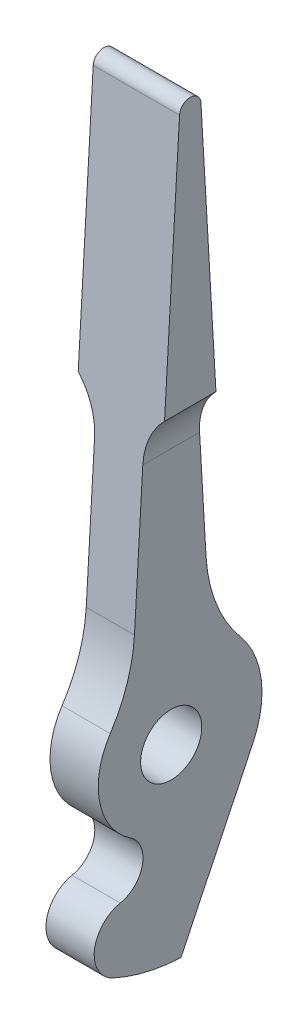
ISO-10303-21;
HEADER;
FILE_DESCRIPTION(('STEP AP214'),'2;1');
FILE_NAME('part.step','',(''),(''),'','','');
FILE_SCHEMA(('AUTOMOTIVE_DESIGN { 1 0 10303 214 1 1 1 1 }'));
ENDSEC;
DATA;
#1=APPLICATION_CONTEXT('core data for automotive mechanical design processes');
#2=APPLICATION_PROTOCOL_DEFINITION('international standard','automotive_design',2000,#1);
#3=PRODUCT_CONTEXT('',#1,'mechanical');
#4=PRODUCT('Part','Part','',(#3));
#5=PRODUCT_RELATED_PRODUCT_CATEGORY('part','',(#4));
#6=PRODUCT_DEFINITION_FORMATION('','',#4);
#7=PRODUCT_DEFINITION_CONTEXT('part definition',#1,'design');
#8=PRODUCT_DEFINITION('design','',#6,#7);
#9=PRODUCT_DEFINITION_SHAPE('','',#8);
#10=(LENGTH_UNIT() NAMED_UNIT(*) SI_UNIT(.MILLI.,.METRE.));
#11=(NAMED_UNIT(*) PLANE_ANGLE_UNIT() SI_UNIT($,.RADIAN.));
#12=(NAMED_UNIT(*) SI_UNIT($,.STERADIAN.) SOLID_ANGLE_UNIT());
#13=UNCERTAINTY_MEASURE_WITH_UNIT(LENGTH_MEASURE(1.E-05),#10,'distance_accuracy_value','');
#14=(GEOMETRIC_REPRESENTATION_CONTEXT(3) GLOBAL_UNCERTAINTY_ASSIGNED_CONTEXT((#13)) GLOBAL_UNIT_ASSIGNED_CONTEXT((#10,
#11,#12)) REPRESENTATION_CONTEXT('',''));
#15=CARTESIAN_POINT('',(0.,0.,0.));
#16=DIRECTION('',(0.,0.,1.));
#17=DIRECTION('',(1.,0.,0.));
#18=AXIS2_PLACEMENT_3D('',#15,#16,#17);
#19=CARTESIAN_POINT('',(3.683,-0.694727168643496,-1.46970668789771));
#20=DIRECTION('',(-1.,0.,0.));
#21=DIRECTION('',(0.,0.,1.));
#22=AXIS2_PLACEMENT_3D('',#19,#20,#21);
#23=PLANE('',#22);
#24=DIRECTION('',(0.,-0.998308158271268,0.0581448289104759));
#25=VECTOR('',#24,1.);
#26=CARTESIAN_POINT('',(3.683,9.65715088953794,3.13324255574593));
#27=LINE('',#26,#25);
#28=CARTESIAN_POINT('',(3.683,47.7797676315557,0.912852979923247));
#29=VERTEX_POINT('',#28);
#30=CARTESIAN_POINT('',(3.683,25.796875,2.19321067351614));
#31=VERTEX_POINT('',#30);
#32=EDGE_CURVE('E175',#29,#31,#27,.T.);
#33=ORIENTED_EDGE('',*,*,#32,.T.);
#34=DIRECTION('',(0.,0.,1.));
#35=VECTOR('',#34,1.);
#36=CARTESIAN_POINT('',(3.683,25.796875,-12.573));
#37=LINE('',#36,#35);
#38=CARTESIAN_POINT('',(3.683,25.796875,-2.19321067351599));
#39=VERTEX_POINT('',#38);
#40=EDGE_CURVE('E162',#39,#31,#37,.T.);
#41=ORIENTED_EDGE('',*,*,#40,.F.);
#42=DIRECTION('',(0.,0.998308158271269,0.0581448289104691));
#43=VECTOR('',#42,1.);
#44=CARTESIAN_POINT('',(3.683,47.7797676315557,-0.912852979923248));
#45=LINE('',#44,#43);
#46=CARTESIAN_POINT('',(3.683,47.7797676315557,-0.912852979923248));
#47=VERTEX_POINT('',#46);
#48=EDGE_CURVE('E179',#39,#47,#45,.T.);
#49=ORIENTED_EDGE('',*,*,#48,.T.);
#50=CARTESIAN_POINT('',(3.683,47.7266,0.));
#51=DIRECTION('',(1.,0.,0.));
#52=DIRECTION('',(0.,0.,-1.));
#53=AXIS2_PLACEMENT_3D('',#50,#51,#52);
#54=CIRCLE('',#53,0.9144);
#55=EDGE_CURVE('E276',#47,#29,#54,.T.);
#56=ORIENTED_EDGE('',*,*,#55,.T.);
#57=EDGE_LOOP('',(#33,#41,#49,#56));
#58=FACE_BOUND('',#57,.T.);
#59=ADVANCED_FACE('F36',(#58),#23,.F.);
#60=CARTESIAN_POINT('',(-3.683,-0.694727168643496,-1.46970668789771));
#61=DIRECTION('',(-1.,0.,0.));
#62=DIRECTION('',(0.,0.,1.));
#63=AXIS2_PLACEMENT_3D('',#60,#61,#62);
#64=PLANE('',#63);
#65=DIRECTION('',(0.,0.,1.));
#66=VECTOR('',#65,1.);
#67=CARTESIAN_POINT('',(-3.683,25.796875,-12.573));
#68=LINE('',#67,#66);
#69=CARTESIAN_POINT('',(-3.683,25.796875,-2.19321067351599));
#70=VERTEX_POINT('',#69);
#71=CARTESIAN_POINT('',(-3.683,25.796875,2.19321067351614));
#72=VERTEX_POINT('',#71);
#73=EDGE_CURVE('E142',#70,#72,#68,.T.);
#74=ORIENTED_EDGE('',*,*,#73,.T.);
#75=DIRECTION('',(0.,-0.998308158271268,0.0581448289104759));
#76=VECTOR('',#75,1.);
#77=CARTESIAN_POINT('',(-3.683,9.65715088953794,3.13324255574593));
#78=LINE('',#77,#76);
#79=CARTESIAN_POINT('',(-3.683,47.7797676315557,0.912852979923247));
#80=VERTEX_POINT('',#79);
#81=EDGE_CURVE('E169',#80,#72,#78,.T.);
#82=ORIENTED_EDGE('',*,*,#81,.F.);
#83=CARTESIAN_POINT('',(-3.683,47.7266,0.));
#84=DIRECTION('',(1.,0.,0.));
#85=DIRECTION('',(0.,0.,-1.));
#86=AXIS2_PLACEMENT_3D('',#83,#84,#85);
#87=CIRCLE('',#86,0.9144);
#88=CARTESIAN_POINT('',(-3.683,47.7797676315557,-0.912852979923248));
#89=VERTEX_POINT('',#88);
#90=EDGE_CURVE('E166',#89,#80,#87,.T.);
#91=ORIENTED_EDGE('',*,*,#90,.F.);
#92=DIRECTION('',(0.,0.998308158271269,0.0581448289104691));
#93=VECTOR('',#92,1.);
#94=CARTESIAN_POINT('',(-3.683,47.7797676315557,-0.912852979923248));
#95=LINE('',#94,#93);
#96=EDGE_CURVE('E158',#70,#89,#95,.T.);
#97=ORIENTED_EDGE('',*,*,#96,.F.);
#98=EDGE_LOOP('',(#74,#82,#91,#97));
#99=FACE_BOUND('',#98,.T.);
#100=ADVANCED_FACE('F165',(#99),#64,.T.);
#101=CARTESIAN_POINT('',(3.683,-0.694727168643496,-1.46970668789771));
#102=DIRECTION('',(-1.,0.,0.));
#103=DIRECTION('',(0.,0.,1.));
#104=AXIS2_PLACEMENT_3D('',#101,#102,#103);
#105=CYLINDRICAL_SURFACE('',#104,15.4686);
#106=DIRECTION('',(-1.,0.,0.));
#107=VECTOR('',#106,1.);
#108=CARTESIAN_POINT('',(3.683,-14.7682384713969,4.95009592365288));
#109=LINE('',#108,#107);
#110=CARTESIAN_POINT('',(2.0574,-14.7682384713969,4.95009592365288));
#111=VERTEX_POINT('',#110);
#112=CARTESIAN_POINT('',(-2.0574,-14.7682384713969,4.95009592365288));
#113=VERTEX_POINT('',#112);
#114=EDGE_CURVE('E180',#111,#113,#109,.T.);
#115=ORIENTED_EDGE('',*,*,#114,.T.);
#116=CARTESIAN_POINT('',(-2.0574,-0.694727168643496,-1.46970668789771));
#117=DIRECTION('',(1.,0.,0.));
#118=DIRECTION('',(0.,0.,-1.));
#119=AXIS2_PLACEMENT_3D('',#116,#117,#118);
#120=CIRCLE('',#119,15.4686);
#121=CARTESIAN_POINT('',(-2.0574,-16.1502613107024,-0.834057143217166));
#122=VERTEX_POINT('',#121);
#123=EDGE_CURVE('E51',#113,#122,#120,.T.);
#124=ORIENTED_EDGE('',*,*,#123,.T.);
#125=DIRECTION('',(-1.,0.,0.));
#126=VECTOR('',#125,1.);
#127=CARTESIAN_POINT('',(3.683,-16.1502613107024,-0.83405714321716));
#128=LINE('',#127,#126);
#129=CARTESIAN_POINT('',(2.0574,-16.1502613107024,-0.834057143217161));
#130=VERTEX_POINT('',#129);
#131=EDGE_CURVE('E208',#130,#122,#128,.T.);
#132=ORIENTED_EDGE('',*,*,#131,.F.);
#133=CARTESIAN_POINT('',(2.0574,-0.694727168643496,-1.46970668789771));
#134=DIRECTION('',(-1.,0.,0.));
#135=DIRECTION('',(0.,0.,1.));
#136=AXIS2_PLACEMENT_3D('',#133,#134,#135);
#137=CIRCLE('',#136,15.4686);
#138=EDGE_CURVE('E262',#130,#111,#137,.T.);
#139=ORIENTED_EDGE('',*,*,#138,.T.);
#140=EDGE_LOOP('',(#115,#124,#132,#139));
#141=FACE_BOUND('',#140,.T.);
#142=ADVANCED_FACE('F38',(#141),#105,.T.);
#143=CARTESIAN_POINT('',(3.683,-3.35549518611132,-6.98259701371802));
#144=DIRECTION('',(0.,0.433134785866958,0.901329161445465));
#145=DIRECTION('',(0.,-0.901329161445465,0.433134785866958));
#146=AXIS2_PLACEMENT_3D('',#143,#144,#145);
#147=PLANE('',#146);
#148=ORIENTED_EDGE('',*,*,#131,.T.);
#149=DIRECTION('',(0.,0.901329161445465,-0.433134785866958));
#150=VECTOR('',#149,1.);
#151=CARTESIAN_POINT('',(-2.0574,-3.35549518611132,-6.98259701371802));
#152=LINE('',#151,#150);
#153=CARTESIAN_POINT('',(-2.0574,-3.35549518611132,-6.98259701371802));
#154=VERTEX_POINT('',#153);
#155=EDGE_CURVE('E238',#122,#154,#152,.T.);
#156=ORIENTED_EDGE('',*,*,#155,.T.);
#157=DIRECTION('',(-1.,0.,0.));
#158=VECTOR('',#157,1.);
#159=CARTESIAN_POINT('',(3.683,-3.35549518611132,-6.98259701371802));
#160=LINE('',#159,#158);
#161=CARTESIAN_POINT('',(2.0574,-3.35549518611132,-6.98259701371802));
#162=VERTEX_POINT('',#161);
#163=EDGE_CURVE('E205',#162,#154,#160,.T.);
#164=ORIENTED_EDGE('',*,*,#163,.F.);
#165=DIRECTION('',(0.,-0.901329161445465,0.433134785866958));
#166=VECTOR('',#165,1.);
#167=CARTESIAN_POINT('',(2.0574,-3.35549518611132,-6.98259701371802));
#168=LINE('',#167,#166);
#169=EDGE_CURVE('E265',#162,#130,#168,.T.);
#170=ORIENTED_EDGE('',*,*,#169,.T.);
#171=EDGE_LOOP('',(#148,#156,#164,#170));
#172=FACE_BOUND('',#171,.T.);
#173=ADVANCED_FACE('F300',(#172),#147,.F.);
#174=CARTESIAN_POINT('',(3.683,0.,0.));
#175=DIRECTION('',(-1.,0.,0.));
#176=DIRECTION('',(0.,0.,1.));
#177=AXIS2_PLACEMENT_3D('',#174,#175,#176);
#178=CYLINDRICAL_SURFACE('',#177,7.747);
#179=ORIENTED_EDGE('',*,*,#163,.T.);
#180=CARTESIAN_POINT('',(-2.0574,0.,0.));
#181=DIRECTION('',(1.,0.,0.));
#182=DIRECTION('',(0.,0.,-1.));
#183=AXIS2_PLACEMENT_3D('',#180,#181,#182);
#184=CIRCLE('',#183,7.747);
#185=CARTESIAN_POINT('',(-2.0574,4.98528738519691,-5.92983293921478));
#186=VERTEX_POINT('',#185);
#187=EDGE_CURVE('E241',#154,#186,#184,.T.);
#188=ORIENTED_EDGE('',*,*,#187,.T.);
#189=DIRECTION('',(-1.,0.,0.));
#190=VECTOR('',#189,1.);
#191=CARTESIAN_POINT('',(3.683,4.98528738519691,-5.92983293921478));
#192=LINE('',#191,#190);
#193=CARTESIAN_POINT('',(2.0574,4.98528738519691,-5.92983293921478));
#194=VERTEX_POINT('',#193);
#195=EDGE_CURVE('E202',#194,#186,#192,.T.);
#196=ORIENTED_EDGE('',*,*,#195,.F.);
#197=CARTESIAN_POINT('',(2.0574,0.,0.));
#198=DIRECTION('',(-1.,0.,0.));
#199=DIRECTION('',(0.,0.,1.));
#200=AXIS2_PLACEMENT_3D('',#197,#198,#199);
#201=CIRCLE('',#200,7.747);
#202=EDGE_CURVE('E268',#194,#162,#201,.T.);
#203=ORIENTED_EDGE('',*,*,#202,.T.);
#204=EDGE_LOOP('',(#179,#188,#196,#203));
#205=FACE_BOUND('',#204,.T.);
#206=ADVANCED_FACE('F297',(#205),#178,.T.);
#207=CARTESIAN_POINT('',(3.683,13.1578896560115,-15.6508705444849));
#208=DIRECTION('',(-1.,0.,0.));
#209=DIRECTION('',(0.,0.,1.));
#210=AXIS2_PLACEMENT_3D('',#207,#208,#209);
#211=CYLINDRICAL_SURFACE('',#210,12.7);
#212=ORIENTED_EDGE('',*,*,#195,.T.);
#213=CARTESIAN_POINT('',(-2.0574,13.1578896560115,-15.6508705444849));
#214=DIRECTION('',(1.,0.,0.));
#215=DIRECTION('',(0.,0.,-1.));
#216=AXIS2_PLACEMENT_3D('',#213,#214,#215);
#217=CIRCLE('',#216,12.7);
#218=CARTESIAN_POINT('',(-2.0574,12.4194503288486,-2.9723569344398));
#219=VERTEX_POINT('',#218);
#220=EDGE_CURVE('E244',#186,#219,#217,.F.);
#221=ORIENTED_EDGE('',*,*,#220,.T.);
#222=DIRECTION('',(-1.,0.,0.));
#223=VECTOR('',#222,1.);
#224=CARTESIAN_POINT('',(3.683,12.4194503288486,-2.9723569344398));
#225=LINE('',#224,#223);
#226=CARTESIAN_POINT('',(2.0574,12.4194503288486,-2.9723569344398));
#227=VERTEX_POINT('',#226);
#228=EDGE_CURVE('E200',#227,#219,#225,.T.);
#229=ORIENTED_EDGE('',*,*,#228,.F.);
#230=CARTESIAN_POINT('',(2.0574,13.1578896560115,-15.6508705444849));
#231=DIRECTION('',(-1.,0.,0.));
#232=DIRECTION('',(0.,0.,1.));
#233=AXIS2_PLACEMENT_3D('',#230,#231,#232);
#234=CIRCLE('',#233,12.7);
#235=EDGE_CURVE('E271',#227,#194,#234,.F.);
#236=ORIENTED_EDGE('',*,*,#235,.T.);
#237=EDGE_LOOP('',(#212,#221,#229,#236));
#238=FACE_BOUND('',#237,.T.);
#239=ADVANCED_FACE('F293',(#238),#211,.F.);
#240=CARTESIAN_POINT('',(3.683,47.7797676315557,-0.912852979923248));
#241=DIRECTION('',(0.,-0.0581448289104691,0.998308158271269));
#242=DIRECTION('',(0.,-0.998308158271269,-0.0581448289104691));
#243=AXIS2_PLACEMENT_3D('',#240,#241,#242);
#244=PLANE('',#243);
#245=DIRECTION('',(0.,0.998308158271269,0.0581448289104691));
#246=VECTOR('',#245,1.);
#247=CARTESIAN_POINT('',(-2.0574,47.7797676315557,-0.912852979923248));
#248=LINE('',#247,#246);
#249=CARTESIAN_POINT('',(-2.0574,21.8698017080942,-2.42193664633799));
#250=VERTEX_POINT('',#249);
#251=EDGE_CURVE('E161',#219,#250,#248,.T.);
#252=ORIENTED_EDGE('',*,*,#251,.T.);
#253=CARTESIAN_POINT('',(-7.61365,21.8698017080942,-2.42193664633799));
#254=DIRECTION('',(0.,-0.0581448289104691,0.998308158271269));
#255=DIRECTION('',(0.,0.998308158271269,0.0581448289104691));
#256=AXIS2_PLACEMENT_3D('',#253,#254,#255);
#257=ELLIPSE('',#256,5.56566622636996,5.55625);
#258=EDGE_CURVE('E146',#250,#70,#257,.T.);
#259=ORIENTED_EDGE('',*,*,#258,.T.);
#260=ORIENTED_EDGE('',*,*,#96,.T.);
#261=DIRECTION('',(-1.,0.,0.));
#262=VECTOR('',#261,1.);
#263=CARTESIAN_POINT('',(3.683,47.7797676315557,-0.912852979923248));
#264=LINE('',#263,#262);
#265=EDGE_CURVE('E198',#47,#89,#264,.T.);
#266=ORIENTED_EDGE('',*,*,#265,.F.);
#267=ORIENTED_EDGE('',*,*,#48,.F.);
#268=CARTESIAN_POINT('',(7.61365,21.8698017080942,-2.42193664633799));
#269=DIRECTION('',(0.,-0.0581448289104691,0.998308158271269));
#270=DIRECTION('',(0.,0.998308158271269,0.0581448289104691));
#271=AXIS2_PLACEMENT_3D('',#268,#269,#270);
#272=ELLIPSE('',#271,5.56566622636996,5.55625);
#273=CARTESIAN_POINT('',(2.0574,21.8698017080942,-2.42193664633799));
#274=VERTEX_POINT('',#273);
#275=EDGE_CURVE('E167',#39,#274,#272,.T.);
#276=ORIENTED_EDGE('',*,*,#275,.T.);
#277=DIRECTION('',(0.,-0.998308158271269,-0.0581448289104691));
#278=VECTOR('',#277,1.);
#279=CARTESIAN_POINT('',(2.0574,47.7797676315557,-0.912852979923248));
#280=LINE('',#279,#278);
#281=EDGE_CURVE('E172',#274,#227,#280,.T.);
#282=ORIENTED_EDGE('',*,*,#281,.T.);
#283=ORIENTED_EDGE('',*,*,#228,.T.);
#284=EDGE_LOOP('',(#252,#259,#260,#266,#267,#276,#282,#283));
#285=FACE_BOUND('',#284,.T.);
#286=ADVANCED_FACE('F156',(#285),#244,.F.);
#287=CARTESIAN_POINT('',(3.683,47.7266,0.));
#288=DIRECTION('',(-1.,0.,0.));
#289=DIRECTION('',(0.,0.,1.));
#290=AXIS2_PLACEMENT_3D('',#287,#288,#289);
#291=CYLINDRICAL_SURFACE('',#290,0.9144);
#292=ORIENTED_EDGE('',*,*,#90,.T.);
#293=DIRECTION('',(-1.,0.,0.));
#294=VECTOR('',#293,1.);
#295=CARTESIAN_POINT('',(3.683,47.7797676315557,0.912852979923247));
#296=LINE('',#295,#294);
#297=EDGE_CURVE('E195',#29,#80,#296,.T.);
#298=ORIENTED_EDGE('',*,*,#297,.F.);
#299=ORIENTED_EDGE('',*,*,#55,.F.);
#300=ORIENTED_EDGE('',*,*,#265,.T.);
#301=EDGE_LOOP('',(#292,#298,#299,#300));
#302=FACE_BOUND('',#301,.T.);
#303=ADVANCED_FACE('F322',(#302),#291,.T.);
#304=CARTESIAN_POINT('',(3.683,9.65715088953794,3.13324255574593));
#305=DIRECTION('',(0.,-0.0581448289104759,-0.998308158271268));
#306=DIRECTION('',(0.,0.998308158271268,-0.0581448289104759));
#307=AXIS2_PLACEMENT_3D('',#304,#305,#306);
#308=PLANE('',#307);
#309=ORIENTED_EDGE('',*,*,#81,.T.);
#310=CARTESIAN_POINT('',(-7.61365,21.8698017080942,2.42193664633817));
#311=DIRECTION('',(0.,-0.0581448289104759,-0.998308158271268));
#312=DIRECTION('',(0.,-0.998308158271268,0.0581448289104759));
#313=AXIS2_PLACEMENT_3D('',#310,#311,#312);
#314=ELLIPSE('',#313,5.56566622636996,5.55625);
#315=CARTESIAN_POINT('',(-2.0574,21.8698017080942,2.42193664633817));
#316=VERTEX_POINT('',#315);
#317=EDGE_CURVE('E11',#72,#316,#314,.T.);
#318=ORIENTED_EDGE('',*,*,#317,.T.);
#319=DIRECTION('',(0.,-0.998308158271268,0.0581448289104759));
#320=VECTOR('',#319,1.);
#321=CARTESIAN_POINT('',(-2.0574,9.65715088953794,3.13324255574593));
#322=LINE('',#321,#320);
#323=CARTESIAN_POINT('',(-2.0574,9.65715088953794,3.13324255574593));
#324=VERTEX_POINT('',#323);
#325=EDGE_CURVE('E234',#316,#324,#322,.T.);
#326=ORIENTED_EDGE('',*,*,#325,.T.);
#327=DIRECTION('',(-1.,0.,0.));
#328=VECTOR('',#327,1.);
#329=CARTESIAN_POINT('',(3.683,9.65715088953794,3.13324255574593));
#330=LINE('',#329,#328);
#331=CARTESIAN_POINT('',(2.0574,9.65715088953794,3.13324255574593));
#332=VERTEX_POINT('',#331);
#333=EDGE_CURVE('E192',#332,#324,#330,.T.);
#334=ORIENTED_EDGE('',*,*,#333,.F.);
#335=DIRECTION('',(0.,0.998308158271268,-0.0581448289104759));
#336=VECTOR('',#335,1.);
#337=CARTESIAN_POINT('',(2.0574,9.65715088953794,3.13324255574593));
#338=LINE('',#337,#336);
#339=CARTESIAN_POINT('',(2.0574,21.8698017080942,2.42193664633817));
#340=VERTEX_POINT('',#339);
#341=EDGE_CURVE('E259',#332,#340,#338,.T.);
#342=ORIENTED_EDGE('',*,*,#341,.T.);
#343=CARTESIAN_POINT('',(7.61365,21.8698017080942,2.42193664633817));
#344=DIRECTION('',(0.,-0.0581448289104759,-0.998308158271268));
#345=DIRECTION('',(0.,-0.998308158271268,0.0581448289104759));
#346=AXIS2_PLACEMENT_3D('',#343,#344,#345);
#347=ELLIPSE('',#346,5.56566622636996,5.55625);
#348=EDGE_CURVE('E44',#340,#31,#347,.T.);
#349=ORIENTED_EDGE('',*,*,#348,.T.);
#350=ORIENTED_EDGE('',*,*,#32,.F.);
#351=ORIENTED_EDGE('',*,*,#297,.T.);
#352=EDGE_LOOP('',(#309,#318,#326,#334,#342,#349,#350,#351));
#353=FACE_BOUND('',#352,.T.);
#354=ADVANCED_FACE('F285',(#353),#308,.F.);
#355=CARTESIAN_POINT('',(3.683,10.395590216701,15.811756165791));
#356=DIRECTION('',(-1.,0.,0.));
#357=DIRECTION('',(0.,0.,1.));
#358=AXIS2_PLACEMENT_3D('',#355,#356,#357);
#359=CYLINDRICAL_SURFACE('',#358,12.7);
#360=ORIENTED_EDGE('',*,*,#333,.T.);
#361=CARTESIAN_POINT('',(-2.0574,10.395590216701,15.811756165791));
#362=DIRECTION('',(1.,0.,0.));
#363=DIRECTION('',(0.,0.,-1.));
#364=AXIS2_PLACEMENT_3D('',#361,#362,#363);
#365=CIRCLE('',#364,12.7);
#366=CARTESIAN_POINT('',(-2.0574,3.41868403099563,5.19983927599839));
#367=VERTEX_POINT('',#366);
#368=EDGE_CURVE('E231',#324,#367,#365,.F.);
#369=ORIENTED_EDGE('',*,*,#368,.T.);
#370=DIRECTION('',(-1.,0.,0.));
#371=VECTOR('',#370,1.);
#372=CARTESIAN_POINT('',(3.683,3.41868403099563,5.19983927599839));
#373=LINE('',#372,#371);
#374=CARTESIAN_POINT('',(2.0574,3.41868403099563,5.19983927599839));
#375=VERTEX_POINT('',#374);
#376=EDGE_CURVE('E189',#375,#367,#373,.T.);
#377=ORIENTED_EDGE('',*,*,#376,.F.);
#378=CARTESIAN_POINT('',(2.0574,10.395590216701,15.811756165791));
#379=DIRECTION('',(-1.,0.,0.));
#380=DIRECTION('',(0.,0.,1.));
#381=AXIS2_PLACEMENT_3D('',#378,#379,#380);
#382=CIRCLE('',#381,12.7);
#383=EDGE_CURVE('E256',#375,#332,#382,.F.);
#384=ORIENTED_EDGE('',*,*,#383,.T.);
#385=EDGE_LOOP('',(#360,#369,#377,#384));
#386=FACE_BOUND('',#385,.T.);
#387=ADVANCED_FACE('F314',(#386),#359,.F.);
#388=CARTESIAN_POINT('',(3.683,0.,0.));
#389=DIRECTION('',(-1.,0.,0.));
#390=DIRECTION('',(0.,0.,1.));
#391=AXIS2_PLACEMENT_3D('',#388,#389,#390);
#392=CYLINDRICAL_SURFACE('',#391,6.223);
#393=ORIENTED_EDGE('',*,*,#376,.T.);
#394=CARTESIAN_POINT('',(-2.0574,0.,0.));
#395=DIRECTION('',(1.,0.,0.));
#396=DIRECTION('',(0.,0.,-1.));
#397=AXIS2_PLACEMENT_3D('',#394,#395,#396);
#398=CIRCLE('',#397,6.223);
#399=CARTESIAN_POINT('',(-2.0574,-5.16530868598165,3.47063613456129));
#400=VERTEX_POINT('',#399);
#401=EDGE_CURVE('E228',#367,#400,#398,.T.);
#402=ORIENTED_EDGE('',*,*,#401,.T.);
#403=DIRECTION('',(-1.,0.,0.));
#404=VECTOR('',#403,1.);
#405=CARTESIAN_POINT('',(3.683,-5.16530868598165,3.47063613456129));
#406=LINE('',#405,#404);
#407=CARTESIAN_POINT('',(2.0574,-5.16530868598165,3.47063613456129));
#408=VERTEX_POINT('',#407);
#409=EDGE_CURVE('E186',#408,#400,#406,.T.);
#410=ORIENTED_EDGE('',*,*,#409,.F.);
#411=CARTESIAN_POINT('',(2.0574,0.,0.));
#412=DIRECTION('',(-1.,0.,0.));
#413=DIRECTION('',(0.,0.,1.));
#414=AXIS2_PLACEMENT_3D('',#411,#412,#413);
#415=CIRCLE('',#414,6.223);
#416=EDGE_CURVE('E253',#408,#375,#415,.T.);
#417=ORIENTED_EDGE('',*,*,#416,.T.);
#418=EDGE_LOOP('',(#393,#402,#410,#417));
#419=FACE_BOUND('',#418,.T.);
#420=ADVANCED_FACE('F311',(#419),#392,.T.);
#421=CARTESIAN_POINT('',(3.683,-7.16818348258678,4.81639300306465));
#422=DIRECTION('',(-1.,0.,0.));
#423=DIRECTION('',(0.,0.,1.));
#424=AXIS2_PLACEMENT_3D('',#421,#422,#423);
#425=CYLINDRICAL_SURFACE('',#424,2.413);
#426=ORIENTED_EDGE('',*,*,#409,.T.);
#427=CARTESIAN_POINT('',(-2.0574,-7.16818348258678,4.81639300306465));
#428=DIRECTION('',(1.,0.,0.));
#429=DIRECTION('',(0.,0.,-1.));
#430=AXIS2_PLACEMENT_3D('',#427,#428,#429);
#431=CIRCLE('',#430,2.413);
#432=CARTESIAN_POINT('',(-2.0574,-9.53440560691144,4.34356971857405));
#433=VERTEX_POINT('',#432);
#434=EDGE_CURVE('E222',#400,#433,#431,.F.);
#435=ORIENTED_EDGE('',*,*,#434,.T.);
#436=DIRECTION('',(-1.,0.,0.));
#437=VECTOR('',#436,1.);
#438=CARTESIAN_POINT('',(3.683,-9.53440560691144,4.34356971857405));
#439=LINE('',#438,#437);
#440=CARTESIAN_POINT('',(2.0574,-9.53440560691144,4.34356971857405));
#441=VERTEX_POINT('',#440);
#442=EDGE_CURVE('E183',#441,#433,#439,.T.);
#443=ORIENTED_EDGE('',*,*,#442,.F.);
#444=CARTESIAN_POINT('',(2.0574,-7.16818348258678,4.81639300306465));
#445=DIRECTION('',(-1.,0.,0.));
#446=DIRECTION('',(0.,0.,1.));
#447=AXIS2_PLACEMENT_3D('',#444,#445,#446);
#448=CIRCLE('',#447,2.413);
#449=EDGE_CURVE('E59',#441,#408,#448,.F.);
#450=ORIENTED_EDGE('',*,*,#449,.T.);
#451=EDGE_LOOP('',(#426,#435,#443,#450));
#452=FACE_BOUND('',#451,.T.);
#453=ADVANCED_FACE('F308',(#452),#425,.F.);
#454=CARTESIAN_POINT('',(3.683,-12.2493341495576,3.80106721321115));
#455=DIRECTION('',(-1.,0.,0.));
#456=DIRECTION('',(0.,0.,1.));
#457=AXIS2_PLACEMENT_3D('',#454,#455,#456);
#458=CYLINDRICAL_SURFACE('',#457,2.7686);
#459=ORIENTED_EDGE('',*,*,#442,.T.);
#460=CARTESIAN_POINT('',(-2.0574,-12.2493341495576,3.80106721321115));
#461=DIRECTION('',(1.,0.,0.));
#462=DIRECTION('',(0.,0.,-1.));
#463=AXIS2_PLACEMENT_3D('',#460,#461,#462);
#464=CIRCLE('',#463,2.7686);
#465=EDGE_CURVE('E219',#433,#113,#464,.T.);
#466=ORIENTED_EDGE('',*,*,#465,.T.);
#467=ORIENTED_EDGE('',*,*,#114,.F.);
#468=CARTESIAN_POINT('',(2.0574,-12.2493341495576,3.80106721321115));
#469=DIRECTION('',(-1.,0.,0.));
#470=DIRECTION('',(0.,0.,1.));
#471=AXIS2_PLACEMENT_3D('',#468,#469,#470);
#472=CIRCLE('',#471,2.7686);
#473=EDGE_CURVE('E214',#111,#441,#472,.T.);
#474=ORIENTED_EDGE('',*,*,#473,.T.);
#475=EDGE_LOOP('',(#459,#466,#467,#474));
#476=FACE_BOUND('',#475,.T.);
#477=ADVANCED_FACE('F305',(#476),#458,.T.);
#478=CARTESIAN_POINT('',(3.683,0.,0.));
#479=DIRECTION('',(-1.,0.,0.));
#480=DIRECTION('',(0.,0.,1.));
#481=AXIS2_PLACEMENT_3D('',#478,#479,#480);
#482=CYLINDRICAL_SURFACE('',#481,2.60985);
#483=CARTESIAN_POINT('',(-2.0574,0.,0.));
#484=DIRECTION('',(1.,0.,0.));
#485=DIRECTION('',(0.,0.,-1.));
#486=AXIS2_PLACEMENT_3D('',#483,#484,#485);
#487=CIRCLE('',#486,2.60985);
#488=CARTESIAN_POINT('',(-2.0574,0.,-2.60985));
#489=VERTEX_POINT('',#488);
#490=EDGE_CURVE('E217',#489,#489,#487,.T.);
#491=ORIENTED_EDGE('',*,*,#490,.F.);
#492=EDGE_LOOP('',(#491));
#493=FACE_BOUND('',#492,.T.);
#494=CARTESIAN_POINT('',(2.0574,0.,0.));
#495=DIRECTION('',(-1.,0.,0.));
#496=DIRECTION('',(0.,0.,1.));
#497=AXIS2_PLACEMENT_3D('',#494,#495,#496);
#498=CIRCLE('',#497,2.60985);
#499=CARTESIAN_POINT('',(2.0574,0.,2.60985));
#500=VERTEX_POINT('',#499);
#501=EDGE_CURVE('E211',#500,#500,#498,.T.);
#502=ORIENTED_EDGE('',*,*,#501,.F.);
#503=EDGE_LOOP('',(#502));
#504=FACE_BOUND('',#503,.T.);
#505=ADVANCED_FACE('F331',(#493,#504),#482,.F.);
#506=CARTESIAN_POINT('',(7.61365,21.8698017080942,-12.573));
#507=DIRECTION('',(0.,0.,1.));
#508=DIRECTION('',(1.,0.,0.));
#509=AXIS2_PLACEMENT_3D('',#506,#507,#508);
#510=CYLINDRICAL_SURFACE('',#509,5.55625);
#511=ORIENTED_EDGE('',*,*,#40,.T.);
#512=ORIENTED_EDGE('',*,*,#348,.F.);
#513=DIRECTION('',(0.,0.,1.));
#514=VECTOR('',#513,1.);
#515=CARTESIAN_POINT('',(2.0574,21.8698017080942,-12.573));
#516=LINE('',#515,#514);
#517=EDGE_CURVE('E215',#274,#340,#516,.T.);
#518=ORIENTED_EDGE('',*,*,#517,.F.);
#519=ORIENTED_EDGE('',*,*,#275,.F.);
#520=EDGE_LOOP('',(#511,#512,#518,#519));
#521=FACE_BOUND('',#520,.T.);
#522=ADVANCED_FACE('F289',(#521),#510,.F.);
#523=CARTESIAN_POINT('',(2.0574,-16.1502613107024,-12.573));
#524=DIRECTION('',(-1.,0.,0.));
#525=DIRECTION('',(0.,0.,1.));
#526=AXIS2_PLACEMENT_3D('',#523,#524,#525);
#527=PLANE('',#526);
#528=ORIENTED_EDGE('',*,*,#501,.T.);
#529=EDGE_LOOP('',(#528));
#530=FACE_BOUND('',#529,.T.);
#531=ORIENTED_EDGE('',*,*,#517,.T.);
#532=ORIENTED_EDGE('',*,*,#341,.F.);
#533=ORIENTED_EDGE('',*,*,#383,.F.);
#534=ORIENTED_EDGE('',*,*,#416,.F.);
#535=ORIENTED_EDGE('',*,*,#449,.F.);
#536=ORIENTED_EDGE('',*,*,#473,.F.);
#537=ORIENTED_EDGE('',*,*,#138,.F.);
#538=ORIENTED_EDGE('',*,*,#169,.F.);
#539=ORIENTED_EDGE('',*,*,#202,.F.);
#540=ORIENTED_EDGE('',*,*,#235,.F.);
#541=ORIENTED_EDGE('',*,*,#281,.F.);
#542=EDGE_LOOP('',(#531,#532,#533,#534,#535,#536,#537,#538,#539,#540,#541));
#543=FACE_BOUND('',#542,.T.);
#544=ADVANCED_FACE('F290',(#530,#543),#527,.F.);
#545=CARTESIAN_POINT('',(-7.61365,21.8698017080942,-12.573));
#546=DIRECTION('',(0.,0.,1.));
#547=DIRECTION('',(1.,0.,0.));
#548=AXIS2_PLACEMENT_3D('',#545,#546,#547);
#549=CYLINDRICAL_SURFACE('',#548,5.55625);
#550=DIRECTION('',(0.,0.,1.));
#551=VECTOR('',#550,1.);
#552=CARTESIAN_POINT('',(-2.0574,21.8698017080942,-12.573));
#553=LINE('',#552,#551);
#554=EDGE_CURVE('E152',#250,#316,#553,.T.);
#555=ORIENTED_EDGE('',*,*,#554,.T.);
#556=ORIENTED_EDGE('',*,*,#317,.F.);
#557=ORIENTED_EDGE('',*,*,#73,.F.);
#558=ORIENTED_EDGE('',*,*,#258,.F.);
#559=EDGE_LOOP('',(#555,#556,#557,#558));
#560=FACE_BOUND('',#559,.T.);
#561=ADVANCED_FACE('F145',(#560),#549,.F.);
#562=CARTESIAN_POINT('',(-2.0574,-16.1502613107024,-12.573));
#563=DIRECTION('',(1.,0.,0.));
#564=DIRECTION('',(0.,0.,-1.));
#565=AXIS2_PLACEMENT_3D('',#562,#563,#564);
#566=PLANE('',#565);
#567=ORIENTED_EDGE('',*,*,#490,.T.);
#568=EDGE_LOOP('',(#567));
#569=FACE_BOUND('',#568,.T.);
#570=ORIENTED_EDGE('',*,*,#220,.F.);
#571=ORIENTED_EDGE('',*,*,#187,.F.);
#572=ORIENTED_EDGE('',*,*,#155,.F.);
#573=ORIENTED_EDGE('',*,*,#123,.F.);
#574=ORIENTED_EDGE('',*,*,#465,.F.);
#575=ORIENTED_EDGE('',*,*,#434,.F.);
#576=ORIENTED_EDGE('',*,*,#401,.F.);
#577=ORIENTED_EDGE('',*,*,#368,.F.);
#578=ORIENTED_EDGE('',*,*,#325,.F.);
#579=ORIENTED_EDGE('',*,*,#554,.F.);
#580=ORIENTED_EDGE('',*,*,#251,.F.);
#581=EDGE_LOOP('',(#570,#571,#572,#573,#574,#575,#576,#577,#578,#579,#580));
#582=FACE_BOUND('',#581,.T.);
#583=ADVANCED_FACE('F295',(#569,#582),#566,.F.);
#584=CLOSED_SHELL('',(#59,#100,#142,#173,#206,#239,#286,#303,#354,#387,#420,#453,#477,#505,#522,
#544,#561,#583));
#585=MANIFOLD_SOLID_BREP('B2',#584);
#586=ADVANCED_BREP_SHAPE_REPRESENTATION('',(#18,#585),#14);
#587=SHAPE_DEFINITION_REPRESENTATION(#9,#586);
ENDSEC;
END-ISO-10303-21;
